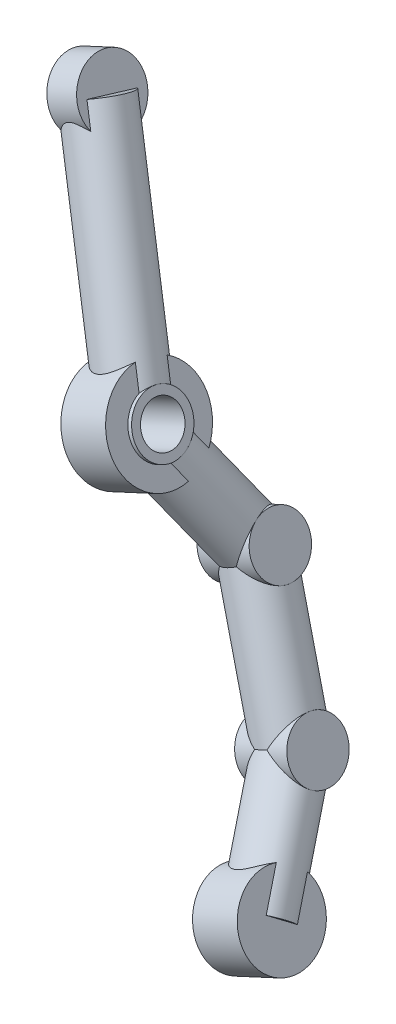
ISO-10303-21;
HEADER;
FILE_DESCRIPTION(('STEP AP214'),'2;1');
FILE_NAME('part.step','',(''),(''),'','','');
FILE_SCHEMA(('AUTOMOTIVE_DESIGN { 1 0 10303 214 1 1 1 1 }'));
ENDSEC;
DATA;
#1=APPLICATION_CONTEXT('core data for automotive mechanical design processes');
#2=APPLICATION_PROTOCOL_DEFINITION('international standard','automotive_design',2000,#1);
#3=PRODUCT_CONTEXT('',#1,'mechanical');
#4=PRODUCT('Part','Part','',(#3));
#5=PRODUCT_RELATED_PRODUCT_CATEGORY('part','',(#4));
#6=PRODUCT_DEFINITION_FORMATION('','',#4);
#7=PRODUCT_DEFINITION_CONTEXT('part definition',#1,'design');
#8=PRODUCT_DEFINITION('design','',#6,#7);
#9=PRODUCT_DEFINITION_SHAPE('','',#8);
#10=(LENGTH_UNIT() NAMED_UNIT(*) SI_UNIT(.MILLI.,.METRE.));
#11=(NAMED_UNIT(*) PLANE_ANGLE_UNIT() SI_UNIT($,.RADIAN.));
#12=(NAMED_UNIT(*) SI_UNIT($,.STERADIAN.) SOLID_ANGLE_UNIT());
#13=UNCERTAINTY_MEASURE_WITH_UNIT(LENGTH_MEASURE(1.E-05),#10,'distance_accuracy_value','');
#14=(GEOMETRIC_REPRESENTATION_CONTEXT(3) GLOBAL_UNCERTAINTY_ASSIGNED_CONTEXT((#13)) GLOBAL_UNIT_ASSIGNED_CONTEXT((#10,
#11,#12)) REPRESENTATION_CONTEXT('',''));
#15=CARTESIAN_POINT('',(0.,0.,0.));
#16=DIRECTION('',(0.,0.,1.));
#17=DIRECTION('',(1.,0.,0.));
#18=AXIS2_PLACEMENT_3D('',#15,#16,#17);
#19=CARTESIAN_POINT('',(455.341566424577,345.362620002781,-22.));
#20=DIRECTION('',(0.336774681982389,-0.725660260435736,0.600000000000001));
#21=DIRECTION('',(0.,-0.637223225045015,-0.77067928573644));
#22=AXIS2_PLACEMENT_3D('',#19,#20,#21);
#23=PLANE('',#22);
#24=CARTESIAN_POINT('',(455.341566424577,345.362620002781,-22.));
#25=DIRECTION('',(0.336774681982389,-0.725660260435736,0.600000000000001));
#26=DIRECTION('',(0.,-0.637223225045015,-0.77067928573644));
#27=AXIS2_PLACEMENT_3D('',#24,#25,#26);
#28=CIRCLE('',#27,3.50000000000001);
#29=CARTESIAN_POINT('',(452.164993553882,345.080866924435,-20.5577794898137));
#30=VERTEX_POINT('',#29);
#31=CARTESIAN_POINT('',(453.075687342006,343.118562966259,-23.4422205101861));
#32=VERTEX_POINT('',#31);
#33=EDGE_CURVE('E276',#30,#32,#28,.T.);
#34=ORIENTED_EDGE('',*,*,#33,.T.);
#35=DIRECTION('',(-0.252581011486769,0.544245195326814,0.799999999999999));
#36=VECTOR('',#35,1.);
#37=CARTESIAN_POINT('',(452.620340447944,344.099714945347,-21.9999999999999));
#38=LINE('',#37,#36);
#39=EDGE_CURVE('E301',#32,#30,#38,.T.);
#40=ORIENTED_EDGE('',*,*,#39,.T.);
#41=EDGE_LOOP('',(#34,#40));
#42=FACE_BOUND('',#41,.T.);
#43=ADVANCED_FACE('F100',(#42),#23,.T.);
#44=CARTESIAN_POINT('',(450.289946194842,356.247523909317,-31.));
#45=DIRECTION('',(0.336774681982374,-0.725660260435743,0.600000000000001));
#46=DIRECTION('',(0.,-0.637223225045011,-0.770679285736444));
#47=AXIS2_PLACEMENT_3D('',#44,#45,#46);
#48=CYLINDRICAL_SURFACE('',#47,3.50000000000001);
#49=CARTESIAN_POINT('',(450.289946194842,356.247523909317,-31.));
#50=DIRECTION('',(0.879534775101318,-0.215449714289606,0.42426406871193));
#51=DIRECTION('',(-0.403263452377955,-0.810788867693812,0.424264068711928));
#52=AXIS2_PLACEMENT_3D('',#49,#50,#51);
#53=ELLIPSE('',#52,4.94974746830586,3.50000000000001);
#54=CARTESIAN_POINT('',(448.293893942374,352.234323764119,-28.9));
#55=VERTEX_POINT('',#54);
#56=CARTESIAN_POINT('',(448.958208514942,357.147420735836,-27.7822113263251));
#57=VERTEX_POINT('',#56);
#58=EDGE_CURVE('E557',#55,#57,#53,.F.);
#59=ORIENTED_EDGE('',*,*,#58,.F.);
#60=CARTESIAN_POINT('',(451.173979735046,354.342665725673,-33.8));
#61=VERTEX_POINT('',#60);
#62=EDGE_CURVE('E554',#61,#55,#53,.F.);
#63=ORIENTED_EDGE('',*,*,#62,.F.);
#64=CARTESIAN_POINT('',(450.289946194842,356.247523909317,-31.));
#65=DIRECTION('',(-0.403263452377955,-0.810788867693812,0.424264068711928));
#66=DIRECTION('',(0.879534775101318,-0.215449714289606,0.42426406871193));
#67=AXIS2_PLACEMENT_3D('',#64,#65,#66);
#68=ELLIPSE('',#67,4.94974746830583,3.50000000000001);
#69=CARTESIAN_POINT('',(454.643421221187,355.181102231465,-28.9));
#70=VERTEX_POINT('',#69);
#71=EDGE_CURVE('E550',#70,#61,#68,.F.);
#72=ORIENTED_EDGE('',*,*,#71,.F.);
#73=CARTESIAN_POINT('',(450.46242659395,357.845519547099,-27.7822113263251));
#74=VERTEX_POINT('',#73);
#75=EDGE_CURVE('E553',#74,#70,#68,.F.);
#76=ORIENTED_EDGE('',*,*,#75,.F.);
#77=CARTESIAN_POINT('',(450.289946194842,356.247523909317,-31.));
#78=DIRECTION('',(0.387024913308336,-0.833936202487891,0.393398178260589));
#79=DIRECTION('',(0.165608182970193,-0.356841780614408,-0.919368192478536));
#80=AXIS2_PLACEMENT_3D('',#77,#78,#79);
#81=ELLIPSE('',#80,3.60255219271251,3.50000000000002);
#82=EDGE_CURVE('E533',#74,#57,#81,.T.);
#83=ORIENTED_EDGE('',*,*,#82,.T.);
#84=EDGE_LOOP('',(#59,#63,#72,#76,#83));
#85=FACE_BOUND('',#84,.T.);
#86=CARTESIAN_POINT('',(451.505074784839,346.502817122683,-26.2404342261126));
#87=CARTESIAN_POINT('',(451.588915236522,346.451164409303,-26.2917693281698));
#88=CARTESIAN_POINT('',(451.676001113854,346.401365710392,-26.339564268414));
#89=CARTESIAN_POINT('',(451.855742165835,346.306144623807,-26.4284221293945));
#90=CARTESIAN_POINT('',(451.948393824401,346.260719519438,-26.4694892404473));
#91=CARTESIAN_POINT('',(452.139014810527,346.174593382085,-26.5455275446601));
#92=CARTESIAN_POINT('',(452.237012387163,346.13392192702,-26.580461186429));
#93=CARTESIAN_POINT('',(452.43708178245,346.058315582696,-26.6444042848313));
#94=CARTESIAN_POINT('',(452.539154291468,346.02338167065,-26.6734127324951));
#95=CARTESIAN_POINT('',(452.746535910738,345.96011135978,-26.7259561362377));
#96=CARTESIAN_POINT('',(452.851839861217,345.931765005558,-26.7494993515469));
#97=CARTESIAN_POINT('',(453.065102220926,345.882564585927,-26.7916828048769));
#98=CARTESIAN_POINT('',(453.173060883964,345.861711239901,-26.8103225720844));
#99=CARTESIAN_POINT('',(453.499386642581,345.812182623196,-26.8595835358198));
#100=CARTESIAN_POINT('',(453.721053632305,345.796264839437,-26.8837507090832));
#101=CARTESIAN_POINT('',(454.093176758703,345.807583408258,-26.9132893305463));
#102=CARTESIAN_POINT('',(454.243749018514,345.822653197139,-26.9221993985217));
#103=CARTESIAN_POINT('',(454.540601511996,345.877031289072,-26.9351209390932));
#104=CARTESIAN_POINT('',(454.686889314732,345.916293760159,-26.9391416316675));
#105=CARTESIAN_POINT('',(454.970959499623,346.020497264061,-26.9430304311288));
#106=CARTESIAN_POINT('',(455.108697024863,346.085562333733,-26.9428782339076));
#107=CARTESIAN_POINT('',(455.370400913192,346.239120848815,-26.938342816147));
#108=CARTESIAN_POINT('',(455.49435398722,346.327636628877,-26.9339555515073));
#109=CARTESIAN_POINT('',(455.745199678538,346.539286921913,-26.9190282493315));
#110=CARTESIAN_POINT('',(455.869230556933,346.66571965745,-26.9075959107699));
#111=CARTESIAN_POINT('',(456.095851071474,346.935730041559,-26.8759660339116));
#112=CARTESIAN_POINT('',(456.198383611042,347.079351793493,-26.8557455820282));
#113=CARTESIAN_POINT('',(456.408882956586,347.417699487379,-26.7973236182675));
#114=CARTESIAN_POINT('',(456.510675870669,347.615664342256,-26.7557181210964));
#115=CARTESIAN_POINT('',(456.684864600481,348.018153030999,-26.6504126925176));
#116=CARTESIAN_POINT('',(456.757305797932,348.222666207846,-26.5867471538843));
#117=CARTESIAN_POINT('',(456.84468751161,348.527834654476,-26.4718899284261));
#118=CARTESIAN_POINT('',(456.870258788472,348.629228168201,-26.4304094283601));
#119=CARTESIAN_POINT('',(456.914250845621,348.830377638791,-26.3406357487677));
#120=CARTESIAN_POINT('',(456.932680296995,348.930135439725,-26.2923509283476));
#121=CARTESIAN_POINT('',(456.947526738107,349.028627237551,-26.2404342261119));
#122=B_SPLINE_CURVE_WITH_KNOTS('',3,(#86,#87,#88,#89,#90,#91,#92,#93,#94,#95,#96,#97,#98,#99,
#100,#101,#102,#103,#104,#105,#106,#107,#108,#109,#110,#111,#112,#113,#114,#115,#116,#117,#118,
#119,#120,#121),.UNSPECIFIED.,.F.,.F.,(4,2,2,2,2,2,2,2,2,2,2,2,2,2,2,2,2,4),(0.,
0.332966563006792,0.66572494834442,1.00045449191,1.3352409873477,1.66951820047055,
2.0038274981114,2.66972985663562,3.12280153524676,3.5750175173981,4.02943424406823,
4.48428532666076,5.01385226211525,5.5448083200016,6.22088122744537,6.89590480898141,
7.23299855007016,7.56968172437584),.UNSPECIFIED.);
#123=CARTESIAN_POINT('',(451.505074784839,346.502817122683,-26.2404342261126));
#124=VERTEX_POINT('',#123);
#125=CARTESIAN_POINT('',(456.947526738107,349.028627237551,-26.2404342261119));
#126=VERTEX_POINT('',#125);
#127=EDGE_CURVE('E118',#124,#126,#122,.T.);
#128=ORIENTED_EDGE('',*,*,#127,.F.);
#129=DIRECTION('',(0.336774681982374,-0.725660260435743,0.600000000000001));
#130=VECTOR('',#129,1.);
#131=CARTESIAN_POINT('',(448.02406711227,354.003466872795,-32.4422205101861));
#132=LINE('',#131,#130);
#133=EDGE_CURVE('E12',#124,#32,#132,.T.);
#134=ORIENTED_EDGE('',*,*,#133,.T.);
#135=ORIENTED_EDGE('',*,*,#33,.F.);
#136=DIRECTION('',(0.336774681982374,-0.725660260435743,0.600000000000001));
#137=VECTOR('',#136,1.);
#138=CARTESIAN_POINT('',(447.113373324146,355.965770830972,-29.5577794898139));
#139=LINE('',#138,#137);
#140=CARTESIAN_POINT('',(450.594380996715,348.465121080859,-23.3559932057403));
#141=VERTEX_POINT('',#140);
#142=EDGE_CURVE('E270',#30,#141,#139,.F.);
#143=ORIENTED_EDGE('',*,*,#142,.T.);
#144=CARTESIAN_POINT('',(456.036832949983,350.990931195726,-23.3559932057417));
#145=CARTESIAN_POINT('',(455.976510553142,350.991908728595,-23.2627581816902));
#146=CARTESIAN_POINT('',(455.914203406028,350.988315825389,-23.1708172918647));
#147=CARTESIAN_POINT('',(455.785864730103,350.972778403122,-22.9903806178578));
#148=CARTESIAN_POINT('',(455.719835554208,350.960839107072,-22.901882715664));
#149=CARTESIAN_POINT('',(455.583820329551,350.929304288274,-22.7285584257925));
#150=CARTESIAN_POINT('',(455.513813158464,350.909663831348,-22.6437568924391));
#151=CARTESIAN_POINT('',(455.37023904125,350.863537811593,-22.4791614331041));
#152=CARTESIAN_POINT('',(455.29667149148,350.837051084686,-22.3993683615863));
#153=CARTESIAN_POINT('',(455.146021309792,350.778080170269,-22.2457518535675));
#154=CARTESIAN_POINT('',(455.068944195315,350.745605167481,-22.1719195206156));
#155=CARTESIAN_POINT('',(454.911057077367,350.675486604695,-22.0310791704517));
#156=CARTESIAN_POINT('',(454.830246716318,350.63784254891,-21.9640718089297));
#157=CARTESIAN_POINT('',(454.582243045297,350.518607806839,-21.7752716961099));
#158=CARTESIAN_POINT('',(454.408871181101,350.430462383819,-21.6650616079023));
#159=CARTESIAN_POINT('',(454.103688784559,350.274904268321,-21.5162609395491));
#160=CARTESIAN_POINT('',(453.976305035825,350.209869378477,-21.4660380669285));
#161=CARTESIAN_POINT('',(453.71498864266,350.07892040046,-21.3898051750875));
#162=CARTESIAN_POINT('',(453.581068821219,350.013008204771,-21.3637496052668));
#163=CARTESIAN_POINT('',(453.308932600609,349.883090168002,-21.3385991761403));
#164=CARTESIAN_POINT('',(453.170698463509,349.819095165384,-21.3396361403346));
#165=CARTESIAN_POINT('',(452.895136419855,349.695397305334,-21.3688613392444));
#166=CARTESIAN_POINT('',(452.757809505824,349.635698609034,-21.3970755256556));
#167=CARTESIAN_POINT('',(452.466448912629,349.511347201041,-21.4841844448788));
#168=CARTESIAN_POINT('',(452.313376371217,349.447491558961,-21.5473576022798));
#169=CARTESIAN_POINT('',(452.018971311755,349.323538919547,-21.6997528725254));
#170=CARTESIAN_POINT('',(451.877670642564,349.263452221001,-21.7890428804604));
#171=CARTESIAN_POINT('',(451.573156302,349.127681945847,-22.0149625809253));
#172=CARTESIAN_POINT('',(451.414508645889,349.052224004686,-22.157860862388));
#173=CARTESIAN_POINT('',(451.125665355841,348.896785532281,-22.4674356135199));
#174=CARTESIAN_POINT('',(450.995425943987,348.816812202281,-22.6340748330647));
#175=CARTESIAN_POINT('',(450.825126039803,348.690310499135,-22.8966596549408));
#176=CARTESIAN_POINT('',(450.77256080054,348.647081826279,-22.9862327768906));
#177=CARTESIAN_POINT('',(450.676512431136,348.558099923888,-23.1687503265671));
#178=CARTESIAN_POINT('',(450.633018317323,348.512349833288,-23.2616905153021));
#179=CARTESIAN_POINT('',(450.594380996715,348.465121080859,-23.3559932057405));
#180=B_SPLINE_CURVE_WITH_KNOTS('',3,(#144,#145,#146,#147,#148,#149,#150,#151,#152,#153,#154,
#155,#156,#157,#158,#159,#160,#161,#162,#163,#164,#165,#166,#167,#168,#169,#170,#171,#172,#173,
#174,#175,#176,#177,#178,#179),.UNSPECIFIED.,.F.,.F.,(4,2,2,2,2,2,2,2,2,2,2,2,2,2,2,2,2,4),(0.,
0.332966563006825,0.66572494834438,1.00045449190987,1.33524098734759,1.66951820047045,
2.00382749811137,2.66972985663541,3.1228015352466,3.57501751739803,4.02943424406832,
4.48428532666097,5.01385226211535,5.54480832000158,6.22088122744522,6.89590480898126,
7.23299855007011,7.56968172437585),.UNSPECIFIED.);
#181=CARTESIAN_POINT('',(456.036832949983,350.990931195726,-23.3559932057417));
#182=VERTEX_POINT('',#181);
#183=EDGE_CURVE('E273',#182,#141,#180,.T.);
#184=ORIENTED_EDGE('',*,*,#183,.F.);
#185=DIRECTION('',(0.336774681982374,-0.725660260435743,0.600000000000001));
#186=VECTOR('',#185,1.);
#187=CARTESIAN_POINT('',(452.555825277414,358.491580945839,-29.557779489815));
#188=LINE('',#187,#186);
#189=CARTESIAN_POINT('',(457.60744550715,347.606677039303,-20.5577794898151));
#190=VERTEX_POINT('',#189);
#191=EDGE_CURVE('E280',#190,#182,#188,.F.);
#192=ORIENTED_EDGE('',*,*,#191,.F.);
#193=CARTESIAN_POINT('',(458.518139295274,345.644373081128,-23.442220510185));
#194=VERTEX_POINT('',#193);
#195=EDGE_CURVE('E456',#194,#190,#28,.T.);
#196=ORIENTED_EDGE('',*,*,#195,.F.);
#197=DIRECTION('',(0.336774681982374,-0.725660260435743,0.600000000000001));
#198=VECTOR('',#197,1.);
#199=CARTESIAN_POINT('',(453.466519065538,356.529276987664,-32.442220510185));
#200=LINE('',#199,#198);
#201=EDGE_CURVE('E109',#126,#194,#200,.T.);
#202=ORIENTED_EDGE('',*,*,#201,.F.);
#203=EDGE_LOOP('',(#128,#134,#135,#143,#184,#192,#196,#202));
#204=FACE_BOUND('',#203,.T.);
#205=ADVANCED_FACE('F272',(#85,#204),#48,.T.);
#206=CARTESIAN_POINT('',(424.610876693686,411.579118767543,-33.));
#207=DIRECTION('',(0.408399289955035,-0.879992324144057,0.242535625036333));
#208=DIRECTION('',(0.90707532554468,0.420968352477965,0.));
#209=AXIS2_PLACEMENT_3D('',#206,#207,#208);
#210=CYLINDRICAL_SURFACE('',#209,3.49999999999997);
#211=CARTESIAN_POINT('',(431.523655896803,389.557483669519,-29.1369228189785));
#212=CARTESIAN_POINT('',(431.592044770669,389.535963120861,-29.2157090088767));
#213=CARTESIAN_POINT('',(431.664062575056,389.515336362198,-29.2915448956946));
#214=CARTESIAN_POINT('',(431.814551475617,389.476477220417,-29.437133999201));
#215=CARTESIAN_POINT('',(431.893020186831,389.458243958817,-29.5068894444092));
#216=CARTESIAN_POINT('',(432.055980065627,389.424695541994,-29.640457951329));
#217=CARTESIAN_POINT('',(432.14049386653,389.409392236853,-29.7042463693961));
#218=CARTESIAN_POINT('',(432.314501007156,389.382463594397,-29.8254576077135));
#219=CARTESIAN_POINT('',(432.403994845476,389.370838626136,-29.8828797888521));
#220=CARTESIAN_POINT('',(432.678790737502,389.342553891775,-30.0454035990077));
#221=CARTESIAN_POINT('',(432.870621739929,389.332437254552,-30.1409358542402));
#222=CARTESIAN_POINT('',(433.264963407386,389.336266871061,-30.3049910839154));
#223=CARTESIAN_POINT('',(433.467449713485,389.350160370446,-30.3735728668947));
#224=CARTESIAN_POINT('',(433.831873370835,389.402324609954,-30.4705902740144));
#225=CARTESIAN_POINT('',(433.993187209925,389.434724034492,-30.5044828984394));
#226=CARTESIAN_POINT('',(434.312944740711,389.520682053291,-30.5537054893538));
#227=CARTESIAN_POINT('',(434.471391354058,389.574217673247,-30.569055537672));
#228=CARTESIAN_POINT('',(434.780617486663,389.702682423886,-30.5806395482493));
#229=CARTESIAN_POINT('',(434.931375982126,389.777666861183,-30.5768236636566));
#230=CARTESIAN_POINT('',(435.22030185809,389.946229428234,-30.550124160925));
#231=CARTESIAN_POINT('',(435.358462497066,390.039817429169,-30.5272303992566));
#232=CARTESIAN_POINT('',(435.615751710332,390.237892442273,-30.4641353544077));
#233=CARTESIAN_POINT('',(435.73531368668,390.341988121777,-30.4244513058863));
#234=CARTESIAN_POINT('',(435.959465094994,390.558476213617,-30.3287850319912));
#235=CARTESIAN_POINT('',(436.064044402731,390.670874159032,-30.2727918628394));
#236=CARTESIAN_POINT('',(436.273580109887,390.917329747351,-30.1352878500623));
#237=CARTESIAN_POINT('',(436.376054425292,391.052032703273,-30.0511599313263));
#238=CARTESIAN_POINT('',(436.561934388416,391.320443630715,-29.8628365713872));
#239=CARTESIAN_POINT('',(436.645347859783,391.454151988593,-29.7586493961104));
#240=CARTESIAN_POINT('',(436.768914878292,391.671719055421,-29.5686043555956));
#241=CARTESIAN_POINT('',(436.814239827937,391.75740049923,-29.4881313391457));
#242=CARTESIAN_POINT('',(436.8964696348,391.924159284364,-29.3187867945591));
#243=CARTESIAN_POINT('',(436.933384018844,392.005241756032,-29.2299249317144));
#244=CARTESIAN_POINT('',(436.966107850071,392.083293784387,-29.1369228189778));
#245=B_SPLINE_CURVE_WITH_KNOTS('',3,(#211,#212,#213,#214,#215,#216,#217,#218,#219,#220,#221,
#222,#223,#224,#225,#226,#227,#228,#229,#230,#231,#232,#233,#234,#235,#236,#237,#238,#239,#240,
#241,#242,#243,#244),.UNSPECIFIED.,.F.,.F.,(4,2,2,2,2,2,2,2,2,2,2,2,2,2,2,2,4),(0.,
0.319418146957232,0.63871872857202,0.959284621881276,1.27988266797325,1.92024942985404,
2.55921098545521,3.06104886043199,3.56234275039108,4.064941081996,4.56780681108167,
5.05619570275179,5.54491307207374,6.10980771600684,6.67447007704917,7.0518172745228,
7.42873489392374),.UNSPECIFIED.);
#246=CARTESIAN_POINT('',(431.523655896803,389.557483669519,-29.1369228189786));
#247=VERTEX_POINT('',#246);
#248=CARTESIAN_POINT('',(436.966107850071,392.083293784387,-29.1369228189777));
#249=VERTEX_POINT('',#248);
#250=EDGE_CURVE('E391',#247,#249,#245,.T.);
#251=ORIENTED_EDGE('',*,*,#250,.F.);
#252=DIRECTION('',(0.408399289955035,-0.879992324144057,0.242535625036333));
#253=VECTOR('',#252,1.);
#254=CARTESIAN_POINT('',(422.073713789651,409.919606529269,-34.7489492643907));
#255=LINE('',#254,#253);
#256=CARTESIAN_POINT('',(432.635629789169,387.16147438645,-28.4765561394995));
#257=VERTEX_POINT('',#256);
#258=EDGE_CURVE('E327',#247,#257,#255,.T.);
#259=ORIENTED_EDGE('',*,*,#258,.T.);
#260=CARTESIAN_POINT('',(436.397990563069,386.181009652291,-26.));
#261=DIRECTION('',(-0.352617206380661,-0.919918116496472,0.171498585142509));
#262=DIRECTION('',(0.930181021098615,-0.324578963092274,0.171498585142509));
#263=AXIS2_PLACEMENT_3D('',#260,#261,#262);
#264=ELLIPSE('',#263,4.9497474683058,3.49999999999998);
#265=CARTESIAN_POINT('',(431.79382940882,387.787593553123,-26.8488746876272));
#266=VERTEX_POINT('',#265);
#267=EDGE_CURVE('E509',#266,#257,#264,.T.);
#268=ORIENTED_EDGE('',*,*,#267,.F.);
#269=CARTESIAN_POINT('',(432.26750364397,387.954688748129,-24.9786576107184));
#270=VERTEX_POINT('',#269);
#271=EDGE_CURVE('E523',#270,#266,#264,.T.);
#272=ORIENTED_EDGE('',*,*,#271,.F.);
#273=DIRECTION('',(0.408399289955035,-0.879992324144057,0.242535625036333));
#274=VECTOR('',#273,1.);
#275=CARTESIAN_POINT('',(421.705587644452,410.712820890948,-31.2510507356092));
#276=LINE('',#275,#274);
#277=CARTESIAN_POINT('',(431.155529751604,390.350698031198,-25.6390242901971));
#278=VERTEX_POINT('',#277);
#279=EDGE_CURVE('E335',#270,#278,#276,.F.);
#280=ORIENTED_EDGE('',*,*,#279,.T.);
#281=CARTESIAN_POINT('',(436.597981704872,392.876508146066,-25.639024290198));
#282=CARTESIAN_POINT('',(436.552266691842,392.849172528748,-25.5467728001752));
#283=CARTESIAN_POINT('',(436.504075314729,392.818459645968,-25.4567871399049));
#284=CARTESIAN_POINT('',(436.402875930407,392.751112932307,-25.2819265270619));
#285=CARTESIAN_POINT('',(436.349869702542,392.714481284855,-25.1970497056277));
#286=CARTESIAN_POINT('',(436.238923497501,392.635954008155,-25.0325918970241));
#287=CARTESIAN_POINT('',(436.180964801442,392.594038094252,-24.9530332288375));
#288=CARTESIAN_POINT('',(436.060346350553,392.505928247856,-24.8001161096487));
#289=CARTESIAN_POINT('',(435.997686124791,392.459733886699,-24.726758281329));
#290=CARTESIAN_POINT('',(435.802690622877,392.316069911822,-24.516843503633));
#291=CARTESIAN_POINT('',(435.663196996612,392.213413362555,-24.3902297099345));
#292=CARTESIAN_POINT('',(435.365147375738,392.002099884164,-24.168989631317));
#293=CARTESIAN_POINT('',(435.20663388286,391.893456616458,-24.0742937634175));
#294=CARTESIAN_POINT('',(434.907060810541,391.701556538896,-23.938763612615));
#295=CARTESIAN_POINT('',(434.769555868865,391.617855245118,-23.8907316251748));
#296=CARTESIAN_POINT('',(434.484927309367,391.45620359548,-23.8206470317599));
#297=CARTESIAN_POINT('',(434.337814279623,391.378247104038,-23.7985663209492));
#298=CARTESIAN_POINT('',(434.037107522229,391.231425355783,-23.7819229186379));
#299=CARTESIAN_POINT('',(433.883497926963,391.162584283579,-23.7874319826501));
#300=CARTESIAN_POINT('',(433.575082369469,391.036016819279,-23.8257058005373));
#301=CARTESIAN_POINT('',(433.420275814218,390.978296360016,-23.8584850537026));
#302=CARTESIAN_POINT('',(433.118940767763,390.875128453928,-23.9477375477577));
#303=CARTESIAN_POINT('',(432.972302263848,390.829375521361,-24.003501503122));
#304=CARTESIAN_POINT('',(432.686268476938,390.746227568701,-24.1359177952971));
#305=CARTESIAN_POINT('',(432.546878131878,390.70883819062,-24.2125841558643));
#306=CARTESIAN_POINT('',(432.257332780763,390.634782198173,-24.3976034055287));
#307=CARTESIAN_POINT('',(432.108886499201,390.599136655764,-24.5090326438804));
#308=CARTESIAN_POINT('',(431.829392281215,390.532439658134,-24.7529505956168));
#309=CARTESIAN_POINT('',(431.698337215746,390.501386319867,-24.8854306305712));
#310=CARTESIAN_POINT('',(431.497256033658,390.450841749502,-25.121508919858));
#311=CARTESIAN_POINT('',(431.421406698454,390.430932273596,-25.2201094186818));
#312=CARTESIAN_POINT('',(431.280292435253,390.391053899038,-25.4244236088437));
#313=CARTESIAN_POINT('',(431.215015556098,390.371085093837,-25.5301290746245));
#314=CARTESIAN_POINT('',(431.155529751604,390.350698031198,-25.6390242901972));
#315=B_SPLINE_CURVE_WITH_KNOTS('',3,(#281,#282,#283,#284,#285,#286,#287,#288,#289,#290,#291,
#292,#293,#294,#295,#296,#297,#298,#299,#300,#301,#302,#303,#304,#305,#306,#307,#308,#309,#310,
#311,#312,#313,#314),.UNSPECIFIED.,.F.,.F.,(4,2,2,2,2,2,2,2,2,2,2,2,2,2,2,2,4),(0.,
0.319418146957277,0.638718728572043,0.959284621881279,1.27988266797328,1.92024942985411,
2.55921098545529,3.06104886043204,3.56234275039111,4.06494108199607,4.56780681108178,
5.05619570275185,5.54491307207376,6.10980771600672,6.67447007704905,7.05181727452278,
7.4287348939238),.UNSPECIFIED.);
#316=CARTESIAN_POINT('',(436.597981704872,392.876508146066,-25.639024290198));
#317=VERTEX_POINT('',#316);
#318=EDGE_CURVE('E383',#317,#278,#315,.T.);
#319=ORIENTED_EDGE('',*,*,#318,.F.);
#320=DIRECTION('',(0.408399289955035,-0.879992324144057,0.242535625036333));
#321=VECTOR('',#320,1.);
#322=CARTESIAN_POINT('',(427.148039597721,413.238631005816,-31.2510507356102));
#323=LINE('',#322,#321);
#324=CARTESIAN_POINT('',(437.709955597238,390.480498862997,-24.978657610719));
#325=VERTEX_POINT('',#324);
#326=EDGE_CURVE('E339',#325,#317,#323,.F.);
#327=ORIENTED_EDGE('',*,*,#326,.F.);
#328=CARTESIAN_POINT('',(436.397990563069,386.181009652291,-26.));
#329=DIRECTION('',(0.930181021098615,-0.324578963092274,0.171498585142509));
#330=DIRECTION('',(-0.352617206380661,-0.919918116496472,0.171498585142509));
#331=AXIS2_PLACEMENT_3D('',#328,#329,#330);
#332=ELLIPSE('',#331,4.94974746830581,3.49999999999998);
#333=CARTESIAN_POINT('',(438.143356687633,390.734372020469,-26.8488746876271));
#334=VERTEX_POINT('',#333);
#335=EDGE_CURVE('E524',#334,#325,#332,.T.);
#336=ORIENTED_EDGE('',*,*,#335,.F.);
#337=CARTESIAN_POINT('',(438.078081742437,389.687284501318,-28.4765561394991));
#338=VERTEX_POINT('',#337);
#339=EDGE_CURVE('E525',#338,#334,#332,.T.);
#340=ORIENTED_EDGE('',*,*,#339,.F.);
#341=DIRECTION('',(0.408399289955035,-0.879992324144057,0.242535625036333));
#342=VECTOR('',#341,1.);
#343=CARTESIAN_POINT('',(427.51616574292,412.445416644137,-34.7489492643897));
#344=LINE('',#343,#342);
#345=EDGE_CURVE('E347',#249,#338,#344,.T.);
#346=ORIENTED_EDGE('',*,*,#345,.F.);
#347=EDGE_LOOP('',(#251,#259,#268,#272,#280,#319,#327,#336,#340,#346));
#348=FACE_BOUND('',#347,.T.);
#349=CARTESIAN_POINT('',(423.640402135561,408.919283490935,-29.5382872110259));
#350=CARTESIAN_POINT('',(423.67755346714,409.001783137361,-29.5039990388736));
#351=CARTESIAN_POINT('',(423.71642867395,409.084507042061,-29.4720776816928));
#352=CARTESIAN_POINT('',(423.798256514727,409.24977594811,-29.4127378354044));
#353=CARTESIAN_POINT('',(423.841217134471,409.332320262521,-29.3853284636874));
#354=CARTESIAN_POINT('',(423.932620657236,409.497932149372,-29.3344053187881));
#355=CARTESIAN_POINT('',(423.981157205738,409.580976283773,-29.3109820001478));
#356=CARTESIAN_POINT('',(424.083833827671,409.744618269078,-29.268595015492));
#357=CARTESIAN_POINT('',(424.137968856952,409.825218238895,-29.2496273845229));
#358=CARTESIAN_POINT('',(424.265336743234,409.99924124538,-29.2124239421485));
#359=CARTESIAN_POINT('',(424.340179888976,410.09173076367,-29.1952078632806));
#360=CARTESIAN_POINT('',(424.501887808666,410.265949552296,-29.1671674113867));
#361=CARTESIAN_POINT('',(424.588677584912,410.347740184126,-29.1563052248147));
#362=CARTESIAN_POINT('',(424.75976755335,410.482320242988,-29.142261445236));
#363=CARTESIAN_POINT('',(424.841933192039,410.537678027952,-29.1380808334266));
#364=CARTESIAN_POINT('',(425.014479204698,410.633841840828,-29.1341701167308));
#365=CARTESIAN_POINT('',(425.10485381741,410.674657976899,-29.1344369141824));
#366=CARTESIAN_POINT('',(425.290657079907,410.740537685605,-29.1393992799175));
#367=CARTESIAN_POINT('',(425.386069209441,410.765649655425,-29.1440811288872));
#368=CARTESIAN_POINT('',(425.579289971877,410.80195447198,-29.1577747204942));
#369=CARTESIAN_POINT('',(425.677103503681,410.813115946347,-29.1667961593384));
#370=CARTESIAN_POINT('',(425.86046258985,410.823554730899,-29.1877007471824));
#371=CARTESIAN_POINT('',(425.946005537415,410.824148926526,-29.1990819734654));
#372=CARTESIAN_POINT('',(426.116383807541,410.818617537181,-29.2251201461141));
#373=CARTESIAN_POINT('',(426.201218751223,410.812488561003,-29.2397787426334));
#374=CARTESIAN_POINT('',(426.369903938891,410.794981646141,-29.272462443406));
#375=CARTESIAN_POINT('',(426.45375089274,410.783589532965,-29.290496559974));
#376=CARTESIAN_POINT('',(426.619921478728,410.756720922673,-29.3299809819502));
#377=CARTESIAN_POINT('',(426.70224573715,410.741246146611,-29.3514298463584));
#378=CARTESIAN_POINT('',(426.866683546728,410.706792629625,-29.3982740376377));
#379=CARTESIAN_POINT('',(426.948766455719,410.68775566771,-29.4237336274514));
#380=CARTESIAN_POINT('',(427.110475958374,410.647176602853,-29.4782632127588));
#381=CARTESIAN_POINT('',(427.190114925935,410.625651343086,-29.50730901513));
#382=CARTESIAN_POINT('',(427.268703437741,410.603156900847,-29.5382872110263));
#383=B_SPLINE_CURVE_WITH_KNOTS('',3,(#349,#350,#351,#352,#353,#354,#355,#356,#357,#358,#359,
#360,#361,#362,#363,#364,#365,#366,#367,#368,#369,#370,#371,#372,#373,#374,#375,#376,#377,#378,
#379,#380,#381,#382),.UNSPECIFIED.,.F.,.F.,(4,2,2,2,2,2,2,2,2,2,2,2,2,2,2,2,4),(0.,
0.290250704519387,0.581080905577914,0.877819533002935,1.17429309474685,1.53402688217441,
1.89159743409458,2.18772895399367,2.48365422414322,2.77866295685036,3.0743339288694,
3.33285850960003,3.5915135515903,3.85086929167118,4.11011587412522,4.37404327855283,
4.63627861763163),.UNSPECIFIED.);
#384=CARTESIAN_POINT('',(423.640402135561,408.919283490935,-29.5382872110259));
#385=VERTEX_POINT('',#384);
#386=CARTESIAN_POINT('',(427.26870343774,410.603156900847,-29.5382872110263));
#387=VERTEX_POINT('',#386);
#388=EDGE_CURVE('E289',#385,#387,#383,.T.);
#389=ORIENTED_EDGE('',*,*,#388,.F.);
#390=DIRECTION('',(0.408399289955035,-0.879992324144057,0.242535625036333));
#391=VECTOR('',#390,1.);
#392=CARTESIAN_POINT('',(422.503466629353,411.369078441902,-30.2134778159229));
#393=LINE('',#392,#391);
#394=CARTESIAN_POINT('',(422.503466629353,411.369078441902,-30.2134778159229));
#395=VERTEX_POINT('',#394);
#396=EDGE_CURVE('E316',#385,#395,#393,.F.);
#397=ORIENTED_EDGE('',*,*,#396,.T.);
#398=CARTESIAN_POINT('',(424.610876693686,411.579118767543,-33.));
#399=DIRECTION('',(0.408399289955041,-0.879992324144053,0.242535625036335));
#400=DIRECTION('',(0.907075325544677,0.420968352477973,0.));
#401=AXIS2_PLACEMENT_3D('',#398,#399,#400);
#402=CIRCLE('',#401,3.49999999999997);
#403=CARTESIAN_POINT('',(423.08998545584,410.105285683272,-35.7865221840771));
#404=VERTEX_POINT('',#403);
#405=EDGE_CURVE('E529',#395,#404,#402,.T.);
#406=ORIENTED_EDGE('',*,*,#405,.T.);
#407=DIRECTION('',(0.408399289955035,-0.879992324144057,0.242535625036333));
#408=VECTOR('',#407,1.);
#409=CARTESIAN_POINT('',(423.08998545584,410.105285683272,-35.786522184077));
#410=LINE('',#409,#408);
#411=CARTESIAN_POINT('',(424.226920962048,407.655490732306,-35.1113315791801));
#412=VERTEX_POINT('',#411);
#413=EDGE_CURVE('E313',#404,#412,#410,.T.);
#414=ORIENTED_EDGE('',*,*,#413,.T.);
#415=CARTESIAN_POINT('',(427.855222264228,409.339364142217,-35.1113315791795));
#416=CARTESIAN_POINT('',(427.777957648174,409.343298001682,-35.1694417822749));
#417=CARTESIAN_POINT('',(427.698914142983,409.347126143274,-35.2252178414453));
#418=CARTESIAN_POINT('',(427.537346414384,409.353675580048,-35.331912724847));
#419=CARTESIAN_POINT('',(427.454815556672,409.356394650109,-35.3828216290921));
#420=CARTESIAN_POINT('',(427.284952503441,409.359842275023,-35.4803394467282));
#421=CARTESIAN_POINT('',(427.197556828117,409.360529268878,-35.526839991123));
#422=CARTESIAN_POINT('',(427.019906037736,409.358436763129,-35.6137518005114));
#423=CARTESIAN_POINT('',(426.929653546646,409.355660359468,-35.6541684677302));
#424=CARTESIAN_POINT('',(426.727059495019,409.343729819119,-35.736046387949));
#425=CARTESIAN_POINT('',(426.614113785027,409.333341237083,-35.7758903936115));
#426=CARTESIAN_POINT('',(426.386678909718,409.300746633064,-35.8429640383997));
#427=CARTESIAN_POINT('',(426.272203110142,409.278612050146,-35.8702680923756));
#428=CARTESIAN_POINT('',(426.064234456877,409.223495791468,-35.9062129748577));
#429=CARTESIAN_POINT('',(425.970515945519,409.19303138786,-35.9172544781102));
#430=CARTESIAN_POINT('',(425.787182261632,409.120112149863,-35.9275716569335));
#431=CARTESIAN_POINT('',(425.69756427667,409.07766568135,-35.9268555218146));
#432=CARTESIAN_POINT('',(425.525405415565,408.982385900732,-35.9137901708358));
#433=CARTESIAN_POINT('',(425.442843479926,408.929585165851,-35.9014769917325));
#434=CARTESIAN_POINT('',(425.285269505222,408.81647096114,-35.8666138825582));
#435=CARTESIAN_POINT('',(425.210274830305,408.756140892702,-35.8440410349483));
#436=CARTESIAN_POINT('',(425.076436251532,408.638998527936,-35.7937277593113));
#437=CARTESIAN_POINT('',(425.016746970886,408.582696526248,-35.7669928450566));
#438=CARTESIAN_POINT('',(424.902021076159,408.468311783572,-35.7079044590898));
#439=CARTESIAN_POINT('',(424.846986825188,408.410228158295,-35.6755481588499));
#440=CARTESIAN_POINT('',(424.740680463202,408.293325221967,-35.605819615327));
#441=CARTESIAN_POINT('',(424.689418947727,408.234504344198,-35.5684340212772));
#442=CARTESIAN_POINT('',(424.590170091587,408.1171743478,-35.4892068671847));
#443=CARTESIAN_POINT('',(424.542181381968,408.058665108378,-35.4473671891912));
#444=CARTESIAN_POINT('',(424.448081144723,407.941559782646,-35.3587517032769));
#445=CARTESIAN_POINT('',(424.402019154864,407.88298120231,-35.3119004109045));
#446=CARTESIAN_POINT('',(424.312617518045,407.767755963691,-35.2144294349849));
#447=CARTESIAN_POINT('',(424.269262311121,407.711099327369,-35.1638358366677));
#448=CARTESIAN_POINT('',(424.226920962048,407.655490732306,-35.1113315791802));
#449=B_SPLINE_CURVE_WITH_KNOTS('',3,(#415,#416,#417,#418,#419,#420,#421,#422,#423,#424,#425,
#426,#427,#428,#429,#430,#431,#432,#433,#434,#435,#436,#437,#438,#439,#440,#441,#442,#443,#444,
#445,#446,#447,#448),.UNSPECIFIED.,.F.,.F.,(4,2,2,2,2,2,2,2,2,2,2,2,2,2,2,2,4),(0.,
0.290250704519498,0.581080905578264,0.877819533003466,1.17429309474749,1.53402688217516,
1.89159743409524,2.18772895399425,2.48365422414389,2.77866295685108,3.07433392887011,
3.33285850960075,3.59151355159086,3.85086929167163,4.11011587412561,4.37404327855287,
4.63627861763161),.UNSPECIFIED.);
#450=CARTESIAN_POINT('',(427.855222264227,409.339364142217,-35.1113315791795));
#451=VERTEX_POINT('',#450);
#452=EDGE_CURVE('E409',#451,#412,#449,.T.);
#453=ORIENTED_EDGE('',*,*,#452,.F.);
#454=DIRECTION('',(0.408399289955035,-0.879992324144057,0.242535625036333));
#455=VECTOR('',#454,1.);
#456=CARTESIAN_POINT('',(426.718286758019,411.789159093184,-35.7865221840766));
#457=LINE('',#456,#455);
#458=CARTESIAN_POINT('',(426.718286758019,411.789159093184,-35.7865221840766));
#459=VERTEX_POINT('',#458);
#460=EDGE_CURVE('E309',#459,#451,#457,.T.);
#461=ORIENTED_EDGE('',*,*,#460,.F.);
#462=CARTESIAN_POINT('',(426.131767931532,413.052951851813,-30.2134778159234));
#463=VERTEX_POINT('',#462);
#464=EDGE_CURVE('E458',#459,#463,#402,.T.);
#465=ORIENTED_EDGE('',*,*,#464,.T.);
#466=DIRECTION('',(0.408399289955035,-0.879992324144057,0.242535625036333));
#467=VECTOR('',#466,1.);
#468=CARTESIAN_POINT('',(426.131767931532,413.052951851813,-30.2134778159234));
#469=LINE('',#468,#467);
#470=EDGE_CURVE('E311',#387,#463,#469,.F.);
#471=ORIENTED_EDGE('',*,*,#470,.F.);
#472=EDGE_LOOP('',(#389,#397,#406,#414,#453,#461,#465,#471));
#473=FACE_BOUND('',#472,.T.);
#474=ADVANCED_FACE('F399',(#348,#473),#210,.T.);
#475=CARTESIAN_POINT('',(424.610876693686,411.579118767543,-33.));
#476=DIRECTION('',(0.408399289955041,-0.879992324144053,0.242535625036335));
#477=DIRECTION('',(0.907075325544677,0.420968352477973,0.));
#478=AXIS2_PLACEMENT_3D('',#475,#476,#477);
#479=PLANE('',#478);
#480=DIRECTION('',(-0.102099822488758,0.219998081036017,0.970142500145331));
#481=VECTOR('',#480,1.);
#482=CARTESIAN_POINT('',(422.796726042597,410.737182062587,-33.));
#483=LINE('',#482,#481);
#484=EDGE_CURVE('E415',#404,#395,#483,.T.);
#485=ORIENTED_EDGE('',*,*,#484,.F.);
#486=ORIENTED_EDGE('',*,*,#405,.F.);
#487=EDGE_LOOP('',(#485,#486));
#488=FACE_BOUND('',#487,.T.);
#489=ADVANCED_FACE('F402',(#488),#479,.F.);
#490=CARTESIAN_POINT('',(436.397990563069,386.181009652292,-26.));
#491=DIRECTION('',(0.371442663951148,-0.800360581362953,-0.470588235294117));
#492=DIRECTION('',(0.,0.506850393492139,-0.862034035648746));
#493=AXIS2_PLACEMENT_3D('',#490,#491,#492);
#494=CYLINDRICAL_SURFACE('',#493,3.49999999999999);
#495=CARTESIAN_POINT('',(442.712515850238,372.574879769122,-34.));
#496=DIRECTION('',(0.90404874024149,-0.268270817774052,-0.332756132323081));
#497=DIRECTION('',(-0.378749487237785,-0.863609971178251,-0.332756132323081));
#498=AXIS2_PLACEMENT_3D('',#495,#496,#497);
#499=ELLIPSE('',#498,4.94974746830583,3.5);
#500=CARTESIAN_POINT('',(444.587230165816,376.849531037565,-32.3529411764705));
#501=VERTEX_POINT('',#500);
#502=CARTESIAN_POINT('',(443.972157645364,372.535577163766,-30.5460551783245));
#503=VERTEX_POINT('',#502);
#504=EDGE_CURVE('E685',#501,#503,#499,.T.);
#505=ORIENTED_EDGE('',*,*,#504,.F.);
#506=CARTESIAN_POINT('',(442.019156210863,374.068886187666,-37.0882352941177));
#507=VERTEX_POINT('',#506);
#508=EDGE_CURVE('E687',#507,#501,#499,.T.);
#509=ORIENTED_EDGE('',*,*,#508,.F.);
#510=CARTESIAN_POINT('',(442.712515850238,372.574879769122,-34.));
#511=DIRECTION('',(-0.378749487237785,-0.863609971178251,-0.332756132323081));
#512=DIRECTION('',(0.90404874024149,-0.268270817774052,-0.332756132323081));
#513=AXIS2_PLACEMENT_3D('',#510,#511,#512);
#514=ELLIPSE('',#513,4.94974746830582,3.5);
#515=CARTESIAN_POINT('',(438.237702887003,373.902752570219,-32.3529411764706));
#516=VERTEX_POINT('',#515);
#517=EDGE_CURVE('E518',#516,#507,#514,.T.);
#518=ORIENTED_EDGE('',*,*,#517,.F.);
#519=CARTESIAN_POINT('',(441.9293426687,371.587518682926,-30.5460551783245));
#520=VERTEX_POINT('',#519);
#521=EDGE_CURVE('E502',#520,#516,#514,.T.);
#522=ORIENTED_EDGE('',*,*,#521,.F.);
#523=CARTESIAN_POINT('',(442.712515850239,372.574879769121,-34.));
#524=DIRECTION('',(0.415428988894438,-0.895139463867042,-0.16169135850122));
#525=DIRECTION('',(-0.0680669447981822,0.146666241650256,-0.986841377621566));
#526=AXIS2_PLACEMENT_3D('',#523,#524,#525);
#527=ELLIPSE('',#526,3.69653577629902,3.50000000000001);
#528=EDGE_CURVE('E530',#503,#520,#527,.T.);
#529=ORIENTED_EDGE('',*,*,#528,.F.);
#530=EDGE_LOOP('',(#505,#509,#518,#522,#529));
#531=FACE_BOUND('',#530,.T.);
#532=CARTESIAN_POINT('',(436.159577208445,379.568300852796,-27.102379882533));
#533=CARTESIAN_POINT('',(436.214780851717,379.575190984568,-27.0115365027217));
#534=CARTESIAN_POINT('',(436.272254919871,379.585902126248,-26.922401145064));
#535=CARTESIAN_POINT('',(436.391539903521,379.614279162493,-26.7482777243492));
#536=CARTESIAN_POINT('',(436.453349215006,379.631942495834,-26.66328814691));
#537=CARTESIAN_POINT('',(436.581394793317,379.673625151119,-26.4977923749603));
#538=CARTESIAN_POINT('',(436.647647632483,379.697669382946,-26.4173052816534));
#539=CARTESIAN_POINT('',(436.784245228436,379.751348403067,-26.2618850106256));
#540=CARTESIAN_POINT('',(436.854590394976,379.780983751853,-26.1869523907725));
#541=CARTESIAN_POINT('',(437.071624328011,379.877160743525,-25.9716083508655));
#542=CARTESIAN_POINT('',(437.224477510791,379.951030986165,-25.8404329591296));
#543=CARTESIAN_POINT('',(437.5459478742,380.111878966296,-25.6097408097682));
#544=CARTESIAN_POINT('',(437.714529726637,380.198827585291,-25.5101552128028));
#545=CARTESIAN_POINT('',(438.028543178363,380.359612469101,-25.3670403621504));
#546=CARTESIAN_POINT('',(438.17117890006,380.432258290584,-25.3160675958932));
#547=CARTESIAN_POINT('',(438.4633000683,380.577765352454,-25.2415730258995));
#548=CARTESIAN_POINT('',(438.61277792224,380.65062627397,-25.2180215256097));
#549=CARTESIAN_POINT('',(438.915266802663,380.793608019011,-25.2002766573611));
#550=CARTESIAN_POINT('',(439.068286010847,380.863721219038,-25.2061598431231));
#551=CARTESIAN_POINT('',(439.372604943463,380.999115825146,-25.246935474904));
#552=CARTESIAN_POINT('',(439.523903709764,381.064394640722,-25.2818433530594));
#553=CARTESIAN_POINT('',(439.815707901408,381.188099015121,-25.376500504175));
#554=CARTESIAN_POINT('',(439.956398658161,381.246667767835,-25.4355056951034));
#555=CARTESIAN_POINT('',(440.228347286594,381.360165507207,-25.5748799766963));
#556=CARTESIAN_POINT('',(440.359598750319,381.415092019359,-25.6552634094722));
#557=CARTESIAN_POINT('',(440.629565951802,381.531333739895,-25.8480287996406));
#558=CARTESIAN_POINT('',(440.766256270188,381.592310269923,-25.9634454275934));
#559=CARTESIAN_POINT('',(441.020128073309,381.714216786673,-26.2139436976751));
#560=CARTESIAN_POINT('',(441.137317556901,381.775146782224,-26.3490172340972));
#561=CARTESIAN_POINT('',(441.313807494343,381.878678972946,-26.5874574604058));
#562=CARTESIAN_POINT('',(441.379415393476,381.92065603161,-26.6864781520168));
#563=CARTESIAN_POINT('',(441.499377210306,382.006112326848,-26.8903266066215));
#564=CARTESIAN_POINT('',(441.553743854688,382.049589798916,-26.9951476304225));
#565=CARTESIAN_POINT('',(441.602029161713,382.094110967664,-27.102379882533));
#566=B_SPLINE_CURVE_WITH_KNOTS('',3,(#532,#533,#534,#535,#536,#537,#538,#539,#540,#541,#542,
#543,#544,#545,#546,#547,#548,#549,#550,#551,#552,#553,#554,#555,#556,#557,#558,#559,#560,#561,
#562,#563,#564,#565),.UNSPECIFIED.,.F.,.F.,(4,2,2,2,2,2,2,2,2,2,2,2,2,2,2,2,4),(0.,
0.319418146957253,0.63871872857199,0.959284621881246,1.27988266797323,1.92024942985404,
2.55921098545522,3.06104886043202,3.5623427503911,4.06494108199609,4.56780681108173,
5.05619570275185,5.54491307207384,6.10980771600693,6.67447007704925,7.0518172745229,
7.42873489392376),.UNSPECIFIED.);
#567=CARTESIAN_POINT('',(436.159577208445,379.568300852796,-27.102379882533));
#568=VERTEX_POINT('',#567);
#569=CARTESIAN_POINT('',(441.602029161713,382.094110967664,-27.102379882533));
#570=VERTEX_POINT('',#569);
#571=EDGE_CURVE('E359',#568,#570,#566,.T.);
#572=ORIENTED_EDGE('',*,*,#571,.F.);
#573=DIRECTION('',(0.371442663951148,-0.800360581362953,-0.470588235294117));
#574=VECTOR('',#573,1.);
#575=CARTESIAN_POINT('',(434.033899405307,384.148573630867,-24.409315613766));
#576=LINE('',#575,#574);
#577=CARTESIAN_POINT('',(435.14822739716,381.747491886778,-25.8210803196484));
#578=VERTEX_POINT('',#577);
#579=EDGE_CURVE('E337',#568,#578,#576,.F.);
#580=ORIENTED_EDGE('',*,*,#579,.T.);
#581=CARTESIAN_POINT('',(436.397990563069,386.181009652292,-26.));
#582=DIRECTION('',(0.90404874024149,-0.268270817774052,-0.332756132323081));
#583=DIRECTION('',(-0.378749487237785,-0.863609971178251,-0.332756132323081));
#584=AXIS2_PLACEMENT_3D('',#581,#582,#583);
#585=ELLIPSE('',#584,4.94974746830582,3.49999999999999);
#586=CARTESIAN_POINT('',(434.523276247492,381.906358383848,-27.6470588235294));
#587=VERTEX_POINT('',#586);
#588=EDGE_CURVE('E540',#587,#578,#585,.F.);
#589=ORIENTED_EDGE('',*,*,#588,.F.);
#590=CARTESIAN_POINT('',(434.433957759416,383.286553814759,-29.0024490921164));
#591=VERTEX_POINT('',#590);
#592=EDGE_CURVE('E511',#591,#587,#585,.F.);
#593=ORIENTED_EDGE('',*,*,#592,.F.);
#594=DIRECTION('',(0.371442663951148,-0.800360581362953,-0.470588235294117));
#595=VECTOR('',#594,1.);
#596=CARTESIAN_POINT('',(433.319629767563,385.687635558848,-27.590684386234));
#597=LINE('',#596,#595);
#598=CARTESIAN_POINT('',(435.4453075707,381.107362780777,-30.283748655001));
#599=VERTEX_POINT('',#598);
#600=EDGE_CURVE('E330',#591,#599,#597,.T.);
#601=ORIENTED_EDGE('',*,*,#600,.T.);
#602=CARTESIAN_POINT('',(440.887759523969,383.633172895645,-30.283748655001));
#603=CARTESIAN_POINT('',(440.811933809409,383.670717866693,-30.3484655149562));
#604=CARTESIAN_POINT('',(440.732789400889,383.706700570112,-30.4101462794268));
#605=CARTESIAN_POINT('',(440.568675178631,383.774918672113,-30.5274746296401));
#606=CARTESIAN_POINT('',(440.483707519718,383.807155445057,-30.5831244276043));
#607=CARTESIAN_POINT('',(440.308355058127,383.867406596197,-30.6886861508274));
#608=CARTESIAN_POINT('',(440.217950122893,383.895403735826,-30.7385744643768));
#609=CARTESIAN_POINT('',(440.032795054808,383.946353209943,-30.8324762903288));
#610=CARTESIAN_POINT('',(439.938044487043,383.969305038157,-30.8764892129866));
#611=CARTESIAN_POINT('',(439.648431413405,384.029516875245,-30.9998812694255));
#612=CARTESIAN_POINT('',(439.447976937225,384.058214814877,-31.0707496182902));
#613=CARTESIAN_POINT('',(439.038928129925,384.08607519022,-31.190486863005));
#614=CARTESIAN_POINT('',(438.830352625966,384.085302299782,-31.2394036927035));
#615=CARTESIAN_POINT('',(438.457357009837,384.051608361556,-31.3077928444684));
#616=CARTESIAN_POINT('',(438.29306689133,384.025622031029,-31.3313312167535));
#617=CARTESIAN_POINT('',(437.968995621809,383.948958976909,-31.3653475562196));
#618=CARTESIAN_POINT('',(437.809209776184,383.89830904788,-31.3758396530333));
#619=CARTESIAN_POINT('',(437.498972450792,383.772023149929,-31.38376785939));
#620=CARTESIAN_POINT('',(437.34854634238,383.696322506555,-31.3811699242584));
#621=CARTESIAN_POINT('',(437.061953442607,383.522732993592,-31.362851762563));
#622=CARTESIAN_POINT('',(436.925794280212,383.424832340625,-31.3471245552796));
#623=CARTESIAN_POINT('',(436.674050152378,383.214809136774,-31.3032203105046));
#624=CARTESIAN_POINT('',(436.55798573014,383.10317715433,-31.2754147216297));
#625=CARTESIAN_POINT('',(436.342319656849,382.868405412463,-31.207345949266));
#626=CARTESIAN_POINT('',(436.242729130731,382.745257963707,-31.1670743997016));
#627=CARTESIAN_POINT('',(436.045531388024,382.472217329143,-31.0665021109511));
#628=CARTESIAN_POINT('',(435.950652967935,382.321147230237,-31.0040578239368));
#629=CARTESIAN_POINT('',(435.781924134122,382.015780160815,-30.8614289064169));
#630=CARTESIAN_POINT('',(435.708065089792,381.861484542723,-30.7812515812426));
#631=CARTESIAN_POINT('',(435.602074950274,381.606043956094,-30.6321289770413));
#632=CARTESIAN_POINT('',(435.564229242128,381.504246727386,-30.5682807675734));
#633=CARTESIAN_POINT('',(435.497823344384,381.303391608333,-30.4322833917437));
#634=CARTESIAN_POINT('',(435.46925263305,381.20433073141,-30.3601437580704));
#635=CARTESIAN_POINT('',(435.4453075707,381.107362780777,-30.2837486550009));
#636=B_SPLINE_CURVE_WITH_KNOTS('',3,(#602,#603,#604,#605,#606,#607,#608,#609,#610,#611,#612,
#613,#614,#615,#616,#617,#618,#619,#620,#621,#622,#623,#624,#625,#626,#627,#628,#629,#630,#631,
#632,#633,#634,#635),.UNSPECIFIED.,.F.,.F.,(4,2,2,2,2,2,2,2,2,2,2,2,2,2,2,2,4),(0.,
0.319418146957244,0.63871872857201,0.9592846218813,1.2798826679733,1.92024942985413,
2.55921098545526,3.06104886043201,3.5623427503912,4.0649410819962,4.5678068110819,
5.05619570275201,5.54491307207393,6.10980771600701,6.67447007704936,7.05181727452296,
7.42873489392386),.UNSPECIFIED.);
#637=CARTESIAN_POINT('',(440.887759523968,383.633172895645,-30.283748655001));
#638=VERTEX_POINT('',#637);
#639=EDGE_CURVE('E351',#638,#599,#636,.T.);
#640=ORIENTED_EDGE('',*,*,#639,.F.);
#641=DIRECTION('',(0.371442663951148,-0.800360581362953,-0.470588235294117));
#642=VECTOR('',#641,1.);
#643=CARTESIAN_POINT('',(438.762081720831,388.213445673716,-27.5906843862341));
#644=LINE('',#643,#642);
#645=CARTESIAN_POINT('',(439.876409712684,385.812363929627,-29.0024490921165));
#646=VERTEX_POINT('',#645);
#647=EDGE_CURVE('E349',#646,#638,#644,.T.);
#648=ORIENTED_EDGE('',*,*,#647,.F.);
#649=CARTESIAN_POINT('',(436.397990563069,386.181009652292,-26.));
#650=DIRECTION('',(-0.378749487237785,-0.863609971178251,-0.332756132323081));
#651=DIRECTION('',(0.90404874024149,-0.268270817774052,-0.332756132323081));
#652=AXIS2_PLACEMENT_3D('',#649,#650,#651);
#653=ELLIPSE('',#652,4.94974746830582,3.49999999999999);
#654=CARTESIAN_POINT('',(440.872803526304,384.853136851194,-27.6470588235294));
#655=VERTEX_POINT('',#654);
#656=EDGE_CURVE('E536',#655,#646,#653,.F.);
#657=ORIENTED_EDGE('',*,*,#656,.F.);
#658=CARTESIAN_POINT('',(440.590679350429,384.273302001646,-25.8210803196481));
#659=VERTEX_POINT('',#658);
#660=EDGE_CURVE('E539',#659,#655,#653,.F.);
#661=ORIENTED_EDGE('',*,*,#660,.F.);
#662=DIRECTION('',(0.371442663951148,-0.800360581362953,-0.470588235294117));
#663=VECTOR('',#662,1.);
#664=CARTESIAN_POINT('',(439.476351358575,386.674383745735,-24.4093156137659));
#665=LINE('',#664,#663);
#666=EDGE_CURVE('E342',#570,#659,#665,.F.);
#667=ORIENTED_EDGE('',*,*,#666,.F.);
#668=EDGE_LOOP('',(#572,#580,#589,#593,#601,#640,#648,#657,#661,#667));
#669=FACE_BOUND('',#668,.T.);
#670=ADVANCED_FACE('F365',(#531,#669),#494,.T.);
#671=CARTESIAN_POINT('',(433.223226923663,384.707620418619,-26.));
#672=DIRECTION('',(0.907075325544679,0.420968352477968,0.));
#673=DIRECTION('',(-0.420968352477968,0.907075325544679,0.));
#674=AXIS2_PLACEMENT_3D('',#671,#672,#673);
#675=CYLINDRICAL_SURFACE('',#674,3.5);
#676=ORIENTED_EDGE('',*,*,#588,.T.);
#677=CARTESIAN_POINT('',(433.676764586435,384.918104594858,-26.));
#678=DIRECTION('',(0.907075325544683,0.42096835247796,0.));
#679=DIRECTION('',(-0.42096835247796,0.907075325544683,0.));
#680=AXIS2_PLACEMENT_3D('',#677,#678,#679);
#681=CIRCLE('',#680,3.5);
#682=EDGE_CURVE('E333',#578,#270,#681,.F.);
#683=ORIENTED_EDGE('',*,*,#682,.T.);
#684=ORIENTED_EDGE('',*,*,#271,.T.);
#685=CARTESIAN_POINT('',(433.223226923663,384.707620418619,-26.));
#686=DIRECTION('',(0.907075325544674,0.420968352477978,0.));
#687=DIRECTION('',(-0.420968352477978,0.907075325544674,0.));
#688=AXIS2_PLACEMENT_3D('',#685,#686,#687);
#689=CIRCLE('',#688,3.5);
#690=EDGE_CURVE('E497',#266,#587,#689,.T.);
#691=ORIENTED_EDGE('',*,*,#690,.T.);
#692=EDGE_LOOP('',(#676,#683,#684,#691));
#693=FACE_BOUND('',#692,.T.);
#694=ADVANCED_FACE('F574',(#693),#675,.T.);
#695=ORIENTED_EDGE('',*,*,#267,.T.);
#696=CARTESIAN_POINT('',(433.676764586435,384.918104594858,-26.));
#697=DIRECTION('',(0.907075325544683,0.42096835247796,0.));
#698=DIRECTION('',(-0.42096835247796,0.907075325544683,0.));
#699=AXIS2_PLACEMENT_3D('',#696,#697,#698);
#700=CIRCLE('',#699,3.5);
#701=EDGE_CURVE('E558',#257,#591,#700,.F.);
#702=ORIENTED_EDGE('',*,*,#701,.T.);
#703=ORIENTED_EDGE('',*,*,#592,.T.);
#704=EDGE_CURVE('E499',#587,#266,#689,.T.);
#705=ORIENTED_EDGE('',*,*,#704,.T.);
#706=EDGE_LOOP('',(#695,#702,#703,#705));
#707=FACE_BOUND('',#706,.T.);
#708=ADVANCED_FACE('F506',(#707),#675,.T.);
#709=CARTESIAN_POINT('',(442.712515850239,372.574879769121,-34.));
#710=DIRECTION('',(0.415240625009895,-0.894733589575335,0.164398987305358));
#711=DIRECTION('',(0.907075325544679,0.420968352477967,0.));
#712=AXIS2_PLACEMENT_3D('',#709,#710,#711);
#713=CYLINDRICAL_SURFACE('',#712,3.50000000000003);
#714=CARTESIAN_POINT('',(450.289946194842,356.247523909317,-31.));
#715=DIRECTION('',(0.935018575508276,-0.335002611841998,0.11624763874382));
#716=DIRECTION('',(-0.347779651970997,-0.930341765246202,0.116247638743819));
#717=AXIS2_PLACEMENT_3D('',#714,#715,#716);
#718=ELLIPSE('',#717,4.94974746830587,3.50000000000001);
#719=CARTESIAN_POINT('',(452.011367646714,360.852480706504,-31.5753964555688));
#720=VERTEX_POINT('',#719);
#721=EDGE_CURVE('E660',#720,#74,#718,.T.);
#722=ORIENTED_EDGE('',*,*,#721,.F.);
#723=CARTESIAN_POINT('',(450.532169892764,355.725595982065,-34.4523787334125));
#724=VERTEX_POINT('',#723);
#725=EDGE_CURVE('E918',#724,#720,#718,.T.);
#726=ORIENTED_EDGE('',*,*,#725,.F.);
#727=CARTESIAN_POINT('',(450.289946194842,356.247523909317,-31.));
#728=DIRECTION('',(-0.347779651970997,-0.930341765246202,0.116247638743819));
#729=DIRECTION('',(0.935018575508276,-0.335002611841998,0.11624763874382));
#730=AXIS2_PLACEMENT_3D('',#727,#728,#729);
#731=ELLIPSE('',#730,4.94974746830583,3.50000000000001);
#732=CARTESIAN_POINT('',(445.661840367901,357.905702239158,-31.5753964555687));
#733=VERTEX_POINT('',#732);
#734=EDGE_CURVE('E682',#733,#724,#731,.T.);
#735=ORIENTED_EDGE('',*,*,#734,.F.);
#736=EDGE_CURVE('E675',#57,#733,#731,.T.);
#737=ORIENTED_EDGE('',*,*,#736,.F.);
#738=ORIENTED_EDGE('',*,*,#82,.F.);
#739=EDGE_LOOP('',(#722,#726,#735,#737,#738));
#740=FACE_BOUND('',#739,.T.);
#741=CARTESIAN_POINT('',(442.712515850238,372.574879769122,-34.));
#742=DIRECTION('',(0.935018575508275,-0.335002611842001,0.11624763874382));
#743=DIRECTION('',(-0.347779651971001,-0.9303417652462,0.116247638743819));
#744=AXIS2_PLACEMENT_3D('',#741,#742,#743);
#745=ELLIPSE('',#744,4.94974746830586,3.50000000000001);
#746=CARTESIAN_POINT('',(440.991094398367,367.969922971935,-33.4246035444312));
#747=VERTEX_POINT('',#746);
#748=EDGE_CURVE('E549',#747,#520,#745,.F.);
#749=ORIENTED_EDGE('',*,*,#748,.F.);
#750=CARTESIAN_POINT('',(442.954739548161,372.052951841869,-37.4523787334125));
#751=VERTEX_POINT('',#750);
#752=EDGE_CURVE('E546',#751,#747,#745,.F.);
#753=ORIENTED_EDGE('',*,*,#752,.F.);
#754=CARTESIAN_POINT('',(442.712515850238,372.574879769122,-34.));
#755=DIRECTION('',(-0.347779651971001,-0.9303417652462,0.116247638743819));
#756=DIRECTION('',(0.935018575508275,-0.335002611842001,0.11624763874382));
#757=AXIS2_PLACEMENT_3D('',#754,#755,#756);
#758=ELLIPSE('',#757,4.94974746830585,3.50000000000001);
#759=CARTESIAN_POINT('',(447.340621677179,370.916701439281,-33.4246035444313));
#760=VERTEX_POINT('',#759);
#761=EDGE_CURVE('E542',#760,#751,#758,.F.);
#762=ORIENTED_EDGE('',*,*,#761,.F.);
#763=EDGE_CURVE('E545',#503,#760,#758,.F.);
#764=ORIENTED_EDGE('',*,*,#763,.F.);
#765=ORIENTED_EDGE('',*,*,#528,.T.);
#766=EDGE_LOOP('',(#749,#753,#762,#764,#765));
#767=FACE_BOUND('',#766,.T.);
#768=ADVANCED_FACE('F453',(#740,#767),#713,.T.);
#769=ORIENTED_EDGE('',*,*,#464,.F.);
#770=DIRECTION('',(-0.102099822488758,0.219998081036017,0.970142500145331));
#771=VECTOR('',#770,1.);
#772=CARTESIAN_POINT('',(426.425027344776,412.421055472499,-33.));
#773=LINE('',#772,#771);
#774=EDGE_CURVE('E397',#459,#463,#773,.T.);
#775=ORIENTED_EDGE('',*,*,#774,.T.);
#776=EDGE_LOOP('',(#769,#775));
#777=FACE_BOUND('',#776,.T.);
#778=ADVANCED_FACE('F102',(#777),#479,.F.);
#779=DIRECTION('',(-0.252581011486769,0.544245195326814,0.799999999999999));
#780=VECTOR('',#779,1.);
#781=CARTESIAN_POINT('',(458.062792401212,346.625525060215,-22.));
#782=LINE('',#781,#780);
#783=EDGE_CURVE('E294',#194,#190,#782,.T.);
#784=ORIENTED_EDGE('',*,*,#783,.F.);
#785=ORIENTED_EDGE('',*,*,#195,.T.);
#786=EDGE_LOOP('',(#784,#785));
#787=FACE_BOUND('',#786,.T.);
#788=ADVANCED_FACE('F437',(#787),#23,.T.);
#789=CARTESIAN_POINT('',(433.223226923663,384.707620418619,-26.));
#790=DIRECTION('',(0.907075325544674,0.420968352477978,0.));
#791=DIRECTION('',(-0.420968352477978,0.907075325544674,0.));
#792=AXIS2_PLACEMENT_3D('',#789,#790,#791);
#793=PLANE('',#792);
#794=CARTESIAN_POINT('',(433.223226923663,384.707620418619,-26.));
#795=DIRECTION('',(0.907075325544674,0.420968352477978,0.));
#796=DIRECTION('',(-0.420968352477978,0.907075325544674,0.));
#797=AXIS2_PLACEMENT_3D('',#794,#795,#796);
#798=CIRCLE('',#797,2.5);
#799=CARTESIAN_POINT('',(432.170806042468,386.975308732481,-26.));
#800=VERTEX_POINT('',#799);
#801=EDGE_CURVE('E292',#800,#800,#798,.T.);
#802=ORIENTED_EDGE('',*,*,#801,.T.);
#803=EDGE_LOOP('',(#802));
#804=FACE_BOUND('',#803,.T.);
#805=ORIENTED_EDGE('',*,*,#690,.F.);
#806=ORIENTED_EDGE('',*,*,#704,.F.);
#807=EDGE_LOOP('',(#805,#806));
#808=FACE_BOUND('',#807,.T.);
#809=ADVANCED_FACE('F444',(#804,#808),#793,.F.);
#810=CARTESIAN_POINT('',(439.572754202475,387.654398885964,-26.));
#811=DIRECTION('',(0.907075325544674,0.420968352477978,0.));
#812=DIRECTION('',(-0.420968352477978,0.907075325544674,0.));
#813=AXIS2_PLACEMENT_3D('',#810,#811,#812);
#814=PLANE('',#813);
#815=CARTESIAN_POINT('',(439.572754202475,387.654398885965,-26.));
#816=DIRECTION('',(0.907075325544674,0.420968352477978,0.));
#817=DIRECTION('',(-0.420968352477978,0.907075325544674,0.));
#818=AXIS2_PLACEMENT_3D('',#815,#816,#817);
#819=CIRCLE('',#818,2.5);
#820=CARTESIAN_POINT('',(438.52033332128,389.922087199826,-26.));
#821=VERTEX_POINT('',#820);
#822=EDGE_CURVE('E104',#821,#821,#819,.T.);
#823=ORIENTED_EDGE('',*,*,#822,.F.);
#824=EDGE_LOOP('',(#823));
#825=FACE_BOUND('',#824,.T.);
#826=CARTESIAN_POINT('',(439.572754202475,387.654398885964,-26.));
#827=DIRECTION('',(0.907075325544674,0.420968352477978,0.));
#828=DIRECTION('',(-0.420968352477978,0.907075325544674,0.));
#829=AXIS2_PLACEMENT_3D('',#826,#827,#828);
#830=CIRCLE('',#829,3.5);
#831=EDGE_CURVE('E515',#655,#334,#830,.T.);
#832=ORIENTED_EDGE('',*,*,#831,.T.);
#833=EDGE_CURVE('E513',#334,#655,#830,.T.);
#834=ORIENTED_EDGE('',*,*,#833,.T.);
#835=EDGE_LOOP('',(#832,#834));
#836=FACE_BOUND('',#835,.T.);
#837=ADVANCED_FACE('F450',(#825,#836),#814,.T.);
#838=CARTESIAN_POINT('',(439.119216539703,387.443914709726,-26.));
#839=DIRECTION('',(0.907075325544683,0.42096835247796,0.));
#840=DIRECTION('',(-0.42096835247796,0.907075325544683,0.));
#841=AXIS2_PLACEMENT_3D('',#838,#839,#840);
#842=CIRCLE('',#841,3.5);
#843=EDGE_CURVE('E345',#338,#646,#842,.F.);
#844=ORIENTED_EDGE('',*,*,#843,.F.);
#845=ORIENTED_EDGE('',*,*,#339,.T.);
#846=ORIENTED_EDGE('',*,*,#831,.F.);
#847=ORIENTED_EDGE('',*,*,#656,.T.);
#848=EDGE_LOOP('',(#844,#845,#846,#847));
#849=FACE_BOUND('',#848,.T.);
#850=ADVANCED_FACE('F593',(#849),#675,.T.);
#851=CARTESIAN_POINT('',(439.119216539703,387.443914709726,-26.));
#852=DIRECTION('',(0.907075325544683,0.42096835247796,0.));
#853=DIRECTION('',(-0.42096835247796,0.907075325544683,0.));
#854=AXIS2_PLACEMENT_3D('',#851,#852,#853);
#855=CIRCLE('',#854,3.5);
#856=EDGE_CURVE('E559',#659,#325,#855,.F.);
#857=ORIENTED_EDGE('',*,*,#856,.F.);
#858=ORIENTED_EDGE('',*,*,#660,.T.);
#859=ORIENTED_EDGE('',*,*,#833,.F.);
#860=ORIENTED_EDGE('',*,*,#335,.T.);
#861=EDGE_LOOP('',(#857,#858,#859,#860));
#862=FACE_BOUND('',#861,.T.);
#863=ADVANCED_FACE('F599',(#862),#675,.T.);
#864=CARTESIAN_POINT('',(439.537752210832,371.101490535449,-34.));
#865=DIRECTION('',(0.907075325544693,0.420968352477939,0.));
#866=DIRECTION('',(-0.420968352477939,0.907075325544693,0.));
#867=AXIS2_PLACEMENT_3D('',#864,#865,#866);
#868=PLANE('',#867);
#869=CARTESIAN_POINT('',(439.537752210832,371.101490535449,-34.));
#870=DIRECTION('',(0.907075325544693,0.420968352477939,0.));
#871=DIRECTION('',(-0.420968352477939,0.907075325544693,0.));
#872=AXIS2_PLACEMENT_3D('',#869,#870,#871);
#873=CIRCLE('',#872,3.5);
#874=EDGE_CURVE('E674',#516,#747,#873,.T.);
#875=ORIENTED_EDGE('',*,*,#874,.F.);
#876=EDGE_CURVE('E671',#747,#516,#873,.T.);
#877=ORIENTED_EDGE('',*,*,#876,.F.);
#878=EDGE_LOOP('',(#875,#877));
#879=FACE_BOUND('',#878,.T.);
#880=ADVANCED_FACE('F635',(#879),#868,.F.);
#881=CARTESIAN_POINT('',(445.887279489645,374.048269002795,-34.));
#882=DIRECTION('',(0.907075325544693,0.420968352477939,0.));
#883=DIRECTION('',(-0.420968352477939,0.907075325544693,0.));
#884=AXIS2_PLACEMENT_3D('',#881,#882,#883);
#885=PLANE('',#884);
#886=CARTESIAN_POINT('',(445.887279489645,374.048269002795,-34.));
#887=DIRECTION('',(0.907075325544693,0.420968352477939,0.));
#888=DIRECTION('',(-0.420968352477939,0.907075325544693,0.));
#889=AXIS2_PLACEMENT_3D('',#886,#887,#888);
#890=CIRCLE('',#889,3.5);
#891=EDGE_CURVE('E677',#760,#501,#890,.T.);
#892=ORIENTED_EDGE('',*,*,#891,.T.);
#893=EDGE_CURVE('E679',#501,#760,#890,.T.);
#894=ORIENTED_EDGE('',*,*,#893,.T.);
#895=EDGE_LOOP('',(#892,#894));
#896=FACE_BOUND('',#895,.T.);
#897=ADVANCED_FACE('F632',(#896),#885,.T.);
#898=CARTESIAN_POINT('',(439.537752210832,371.101490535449,-34.));
#899=DIRECTION('',(0.907075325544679,0.420968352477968,0.));
#900=DIRECTION('',(-0.420968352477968,0.907075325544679,0.));
#901=AXIS2_PLACEMENT_3D('',#898,#899,#900);
#902=CYLINDRICAL_SURFACE('',#901,3.5);
#903=ORIENTED_EDGE('',*,*,#748,.T.);
#904=ORIENTED_EDGE('',*,*,#521,.T.);
#905=ORIENTED_EDGE('',*,*,#874,.T.);
#906=EDGE_LOOP('',(#903,#904,#905));
#907=FACE_BOUND('',#906,.T.);
#908=ADVANCED_FACE('F631',(#907),#902,.T.);
#909=ORIENTED_EDGE('',*,*,#876,.T.);
#910=ORIENTED_EDGE('',*,*,#517,.T.);
#911=ORIENTED_EDGE('',*,*,#508,.T.);
#912=ORIENTED_EDGE('',*,*,#891,.F.);
#913=ORIENTED_EDGE('',*,*,#761,.T.);
#914=ORIENTED_EDGE('',*,*,#752,.T.);
#915=EDGE_LOOP('',(#909,#910,#911,#912,#913,#914));
#916=FACE_BOUND('',#915,.T.);
#917=ADVANCED_FACE('F629',(#916),#902,.T.);
#918=ORIENTED_EDGE('',*,*,#893,.F.);
#919=ORIENTED_EDGE('',*,*,#504,.T.);
#920=ORIENTED_EDGE('',*,*,#763,.T.);
#921=EDGE_LOOP('',(#918,#919,#920));
#922=FACE_BOUND('',#921,.T.);
#923=ADVANCED_FACE('F625',(#922),#902,.T.);
#924=CARTESIAN_POINT('',(447.115182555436,354.774134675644,-31.));
#925=DIRECTION('',(0.907075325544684,0.420968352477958,0.));
#926=DIRECTION('',(-0.420968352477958,0.907075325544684,0.));
#927=AXIS2_PLACEMENT_3D('',#924,#925,#926);
#928=PLANE('',#927);
#929=CARTESIAN_POINT('',(447.115182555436,354.774134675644,-31.));
#930=DIRECTION('',(0.907075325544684,0.420968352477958,0.));
#931=DIRECTION('',(-0.420968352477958,0.907075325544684,0.));
#932=AXIS2_PLACEMENT_3D('',#929,#930,#931);
#933=CIRCLE('',#932,3.5);
#934=EDGE_CURVE('E913',#733,#55,#933,.T.);
#935=ORIENTED_EDGE('',*,*,#934,.F.);
#936=EDGE_CURVE('E909',#55,#733,#933,.T.);
#937=ORIENTED_EDGE('',*,*,#936,.F.);
#938=EDGE_LOOP('',(#935,#937));
#939=FACE_BOUND('',#938,.T.);
#940=ADVANCED_FACE('F621',(#939),#928,.F.);
#941=CARTESIAN_POINT('',(453.464709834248,357.72091314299,-31.));
#942=DIRECTION('',(0.907075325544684,0.420968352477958,0.));
#943=DIRECTION('',(-0.420968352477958,0.907075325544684,0.));
#944=AXIS2_PLACEMENT_3D('',#941,#942,#943);
#945=PLANE('',#944);
#946=CARTESIAN_POINT('',(453.464709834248,357.72091314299,-31.));
#947=DIRECTION('',(0.907075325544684,0.420968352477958,0.));
#948=DIRECTION('',(-0.420968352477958,0.907075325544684,0.));
#949=AXIS2_PLACEMENT_3D('',#946,#947,#948);
#950=CIRCLE('',#949,3.5);
#951=EDGE_CURVE('E915',#70,#720,#950,.T.);
#952=ORIENTED_EDGE('',*,*,#951,.T.);
#953=EDGE_CURVE('E912',#720,#70,#950,.T.);
#954=ORIENTED_EDGE('',*,*,#953,.T.);
#955=EDGE_LOOP('',(#952,#954));
#956=FACE_BOUND('',#955,.T.);
#957=ADVANCED_FACE('F618',(#956),#945,.T.);
#958=CARTESIAN_POINT('',(447.115182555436,354.774134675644,-31.));
#959=DIRECTION('',(0.907075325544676,0.420968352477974,0.));
#960=DIRECTION('',(-0.420968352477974,0.907075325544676,0.));
#961=AXIS2_PLACEMENT_3D('',#958,#959,#960);
#962=CYLINDRICAL_SURFACE('',#961,3.5);
#963=ORIENTED_EDGE('',*,*,#58,.T.);
#964=ORIENTED_EDGE('',*,*,#736,.T.);
#965=ORIENTED_EDGE('',*,*,#934,.T.);
#966=EDGE_LOOP('',(#963,#964,#965));
#967=FACE_BOUND('',#966,.T.);
#968=ADVANCED_FACE('F617',(#967),#962,.T.);
#969=ORIENTED_EDGE('',*,*,#936,.T.);
#970=ORIENTED_EDGE('',*,*,#734,.T.);
#971=ORIENTED_EDGE('',*,*,#725,.T.);
#972=ORIENTED_EDGE('',*,*,#951,.F.);
#973=ORIENTED_EDGE('',*,*,#71,.T.);
#974=ORIENTED_EDGE('',*,*,#62,.T.);
#975=EDGE_LOOP('',(#969,#970,#971,#972,#973,#974));
#976=FACE_BOUND('',#975,.T.);
#977=ADVANCED_FACE('F615',(#976),#962,.T.);
#978=ORIENTED_EDGE('',*,*,#953,.F.);
#979=ORIENTED_EDGE('',*,*,#721,.T.);
#980=ORIENTED_EDGE('',*,*,#75,.T.);
#981=EDGE_LOOP('',(#978,#979,#980));
#982=FACE_BOUND('',#981,.T.);
#983=ADVANCED_FACE('F604',(#982),#962,.T.);
#984=CARTESIAN_POINT('',(433.676764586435,384.918104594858,-26.));
#985=DIRECTION('',(0.907075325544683,0.42096835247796,0.));
#986=DIRECTION('',(-0.42096835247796,0.907075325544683,0.));
#987=AXIS2_PLACEMENT_3D('',#984,#985,#986);
#988=PLANE('',#987);
#989=ORIENTED_EDGE('',*,*,#600,.F.);
#990=ORIENTED_EDGE('',*,*,#701,.F.);
#991=ORIENTED_EDGE('',*,*,#258,.F.);
#992=CARTESIAN_POINT('',(433.676764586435,384.918104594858,-26.));
#993=DIRECTION('',(0.907075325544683,0.42096835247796,0.));
#994=DIRECTION('',(-0.42096835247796,0.907075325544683,0.));
#995=AXIS2_PLACEMENT_3D('',#992,#993,#994);
#996=CIRCLE('',#995,6.);
#997=EDGE_CURVE('E319',#599,#247,#996,.T.);
#998=ORIENTED_EDGE('',*,*,#997,.F.);
#999=EDGE_LOOP('',(#989,#990,#991,#998));
#1000=FACE_BOUND('',#999,.T.);
#1001=ADVANCED_FACE('F582',(#1000),#988,.F.);
#1002=CARTESIAN_POINT('',(439.119216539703,387.443914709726,-26.));
#1003=DIRECTION('',(0.907075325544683,0.42096835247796,0.));
#1004=DIRECTION('',(-0.42096835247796,0.907075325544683,0.));
#1005=AXIS2_PLACEMENT_3D('',#1002,#1003,#1004);
#1006=PLANE('',#1005);
#1007=ORIENTED_EDGE('',*,*,#843,.T.);
#1008=ORIENTED_EDGE('',*,*,#647,.T.);
#1009=CARTESIAN_POINT('',(439.119216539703,387.443914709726,-26.));
#1010=DIRECTION('',(0.907075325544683,0.42096835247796,0.));
#1011=DIRECTION('',(-0.42096835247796,0.907075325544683,0.));
#1012=AXIS2_PLACEMENT_3D('',#1009,#1010,#1011);
#1013=CIRCLE('',#1012,6.);
#1014=EDGE_CURVE('E323',#638,#249,#1013,.T.);
#1015=ORIENTED_EDGE('',*,*,#1014,.T.);
#1016=ORIENTED_EDGE('',*,*,#345,.T.);
#1017=EDGE_LOOP('',(#1007,#1008,#1015,#1016));
#1018=FACE_BOUND('',#1017,.T.);
#1019=ADVANCED_FACE('F374',(#1018),#1006,.T.);
#1020=CARTESIAN_POINT('',(433.676764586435,384.918104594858,-26.));
#1021=DIRECTION('',(0.907075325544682,0.420968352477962,0.));
#1022=DIRECTION('',(-0.420968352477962,0.907075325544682,0.));
#1023=AXIS2_PLACEMENT_3D('',#1020,#1021,#1022);
#1024=CYLINDRICAL_SURFACE('',#1023,6.);
#1025=ORIENTED_EDGE('',*,*,#1014,.F.);
#1026=ORIENTED_EDGE('',*,*,#639,.T.);
#1027=ORIENTED_EDGE('',*,*,#997,.T.);
#1028=ORIENTED_EDGE('',*,*,#250,.T.);
#1029=EDGE_LOOP('',(#1025,#1026,#1027,#1028));
#1030=FACE_BOUND('',#1029,.T.);
#1031=ADVANCED_FACE('F368',(#1030),#1024,.T.);
#1032=EDGE_CURVE('E320',#278,#568,#996,.T.);
#1033=ORIENTED_EDGE('',*,*,#1032,.T.);
#1034=ORIENTED_EDGE('',*,*,#571,.T.);
#1035=EDGE_CURVE('E324',#317,#570,#1013,.T.);
#1036=ORIENTED_EDGE('',*,*,#1035,.F.);
#1037=ORIENTED_EDGE('',*,*,#318,.T.);
#1038=EDGE_LOOP('',(#1033,#1034,#1036,#1037));
#1039=FACE_BOUND('',#1038,.T.);
#1040=ADVANCED_FACE('F373',(#1039),#1024,.T.);
#1041=ORIENTED_EDGE('',*,*,#579,.F.);
#1042=ORIENTED_EDGE('',*,*,#1032,.F.);
#1043=ORIENTED_EDGE('',*,*,#279,.F.);
#1044=ORIENTED_EDGE('',*,*,#682,.F.);
#1045=EDGE_LOOP('',(#1041,#1042,#1043,#1044));
#1046=FACE_BOUND('',#1045,.T.);
#1047=ADVANCED_FACE('F571',(#1046),#988,.F.);
#1048=ORIENTED_EDGE('',*,*,#1035,.T.);
#1049=ORIENTED_EDGE('',*,*,#666,.T.);
#1050=ORIENTED_EDGE('',*,*,#856,.T.);
#1051=ORIENTED_EDGE('',*,*,#326,.T.);
#1052=EDGE_LOOP('',(#1048,#1049,#1050,#1051));
#1053=FACE_BOUND('',#1052,.T.);
#1054=ADVANCED_FACE('F378',(#1053),#1006,.T.);
#1055=CARTESIAN_POINT('',(422.796726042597,410.737182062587,-33.));
#1056=DIRECTION('',(0.907075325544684,0.420968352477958,0.));
#1057=DIRECTION('',(-0.420968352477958,0.907075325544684,0.));
#1058=AXIS2_PLACEMENT_3D('',#1055,#1056,#1057);
#1059=PLANE('',#1058);
#1060=ORIENTED_EDGE('',*,*,#396,.F.);
#1061=CARTESIAN_POINT('',(422.796726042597,410.737182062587,-33.));
#1062=DIRECTION('',(0.907075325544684,0.420968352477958,0.));
#1063=DIRECTION('',(-0.420968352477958,0.907075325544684,0.));
#1064=AXIS2_PLACEMENT_3D('',#1061,#1062,#1063);
#1065=CIRCLE('',#1064,4.);
#1066=EDGE_CURVE('E303',#412,#385,#1065,.T.);
#1067=ORIENTED_EDGE('',*,*,#1066,.F.);
#1068=ORIENTED_EDGE('',*,*,#413,.F.);
#1069=ORIENTED_EDGE('',*,*,#484,.T.);
#1070=EDGE_LOOP('',(#1060,#1067,#1068,#1069));
#1071=FACE_BOUND('',#1070,.T.);
#1072=ADVANCED_FACE('F376',(#1071),#1059,.F.);
#1073=CARTESIAN_POINT('',(426.425027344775,412.421055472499,-33.));
#1074=DIRECTION('',(0.907075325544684,0.420968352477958,0.));
#1075=DIRECTION('',(-0.420968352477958,0.907075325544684,0.));
#1076=AXIS2_PLACEMENT_3D('',#1073,#1074,#1075);
#1077=PLANE('',#1076);
#1078=CARTESIAN_POINT('',(426.425027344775,412.421055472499,-33.));
#1079=DIRECTION('',(0.907075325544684,0.420968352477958,0.));
#1080=DIRECTION('',(-0.420968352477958,0.907075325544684,0.));
#1081=AXIS2_PLACEMENT_3D('',#1078,#1079,#1080);
#1082=CIRCLE('',#1081,4.);
#1083=EDGE_CURVE('E306',#451,#387,#1082,.T.);
#1084=ORIENTED_EDGE('',*,*,#1083,.T.);
#1085=ORIENTED_EDGE('',*,*,#470,.T.);
#1086=ORIENTED_EDGE('',*,*,#774,.F.);
#1087=ORIENTED_EDGE('',*,*,#460,.T.);
#1088=EDGE_LOOP('',(#1084,#1085,#1086,#1087));
#1089=FACE_BOUND('',#1088,.T.);
#1090=ADVANCED_FACE('F424',(#1089),#1077,.T.);
#1091=CARTESIAN_POINT('',(422.796726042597,410.737182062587,-33.));
#1092=DIRECTION('',(0.907075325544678,0.42096835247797,0.));
#1093=DIRECTION('',(-0.42096835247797,0.907075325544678,0.));
#1094=AXIS2_PLACEMENT_3D('',#1091,#1092,#1093);
#1095=CYLINDRICAL_SURFACE('',#1094,4.);
#1096=ORIENTED_EDGE('',*,*,#1066,.T.);
#1097=ORIENTED_EDGE('',*,*,#388,.T.);
#1098=ORIENTED_EDGE('',*,*,#1083,.F.);
#1099=ORIENTED_EDGE('',*,*,#452,.T.);
#1100=EDGE_LOOP('',(#1096,#1097,#1098,#1099));
#1101=FACE_BOUND('',#1100,.T.);
#1102=ADVANCED_FACE('F420',(#1101),#1095,.T.);
#1103=CARTESIAN_POINT('',(452.620340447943,344.099714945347,-22.));
#1104=DIRECTION('',(0.907075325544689,0.420968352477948,0.));
#1105=DIRECTION('',(-0.420968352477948,0.907075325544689,0.));
#1106=AXIS2_PLACEMENT_3D('',#1103,#1104,#1105);
#1107=PLANE('',#1106);
#1108=ORIENTED_EDGE('',*,*,#142,.F.);
#1109=ORIENTED_EDGE('',*,*,#39,.F.);
#1110=ORIENTED_EDGE('',*,*,#133,.F.);
#1111=CARTESIAN_POINT('',(452.620340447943,344.099714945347,-22.));
#1112=DIRECTION('',(0.907075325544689,0.420968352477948,0.));
#1113=DIRECTION('',(-0.420968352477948,0.907075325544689,0.));
#1114=AXIS2_PLACEMENT_3D('',#1111,#1112,#1113);
#1115=CIRCLE('',#1114,5.);
#1116=EDGE_CURVE('E286',#141,#124,#1115,.T.);
#1117=ORIENTED_EDGE('',*,*,#1116,.F.);
#1118=EDGE_LOOP('',(#1108,#1109,#1110,#1117));
#1119=FACE_BOUND('',#1118,.T.);
#1120=ADVANCED_FACE('F291',(#1119),#1107,.F.);
#1121=CARTESIAN_POINT('',(458.062792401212,346.625525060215,-22.));
#1122=DIRECTION('',(0.907075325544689,0.420968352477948,0.));
#1123=DIRECTION('',(-0.420968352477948,0.907075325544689,0.));
#1124=AXIS2_PLACEMENT_3D('',#1121,#1122,#1123);
#1125=PLANE('',#1124);
#1126=ORIENTED_EDGE('',*,*,#783,.T.);
#1127=ORIENTED_EDGE('',*,*,#191,.T.);
#1128=CARTESIAN_POINT('',(458.062792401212,346.625525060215,-22.));
#1129=DIRECTION('',(0.907075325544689,0.420968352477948,0.));
#1130=DIRECTION('',(-0.420968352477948,0.907075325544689,0.));
#1131=AXIS2_PLACEMENT_3D('',#1128,#1129,#1130);
#1132=CIRCLE('',#1131,5.);
#1133=EDGE_CURVE('E288',#182,#126,#1132,.T.);
#1134=ORIENTED_EDGE('',*,*,#1133,.T.);
#1135=ORIENTED_EDGE('',*,*,#201,.T.);
#1136=EDGE_LOOP('',(#1126,#1127,#1134,#1135));
#1137=FACE_BOUND('',#1136,.T.);
#1138=ADVANCED_FACE('F460',(#1137),#1125,.T.);
#1139=CARTESIAN_POINT('',(452.620340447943,344.099714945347,-22.));
#1140=DIRECTION('',(0.907075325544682,0.420968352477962,0.));
#1141=DIRECTION('',(-0.420968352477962,0.907075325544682,0.));
#1142=AXIS2_PLACEMENT_3D('',#1139,#1140,#1141);
#1143=CYLINDRICAL_SURFACE('',#1142,5.);
#1144=ORIENTED_EDGE('',*,*,#1116,.T.);
#1145=ORIENTED_EDGE('',*,*,#127,.T.);
#1146=ORIENTED_EDGE('',*,*,#1133,.F.);
#1147=ORIENTED_EDGE('',*,*,#183,.T.);
#1148=EDGE_LOOP('',(#1144,#1145,#1146,#1147));
#1149=FACE_BOUND('',#1148,.T.);
#1150=ADVANCED_FACE('F285',(#1149),#1143,.T.);
#1151=CARTESIAN_POINT('',(432.76968926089,384.49713624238,-26.));
#1152=DIRECTION('',(0.907075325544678,0.42096835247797,0.));
#1153=DIRECTION('',(-0.42096835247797,0.907075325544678,0.));
#1154=AXIS2_PLACEMENT_3D('',#1151,#1152,#1153);
#1155=CYLINDRICAL_SURFACE('',#1154,2.5);
#1156=ORIENTED_EDGE('',*,*,#822,.T.);
#1157=EDGE_LOOP('',(#1156));
#1158=FACE_BOUND('',#1157,.T.);
#1159=ORIENTED_EDGE('',*,*,#801,.F.);
#1160=EDGE_LOOP('',(#1159));
#1161=FACE_BOUND('',#1160,.T.);
#1162=ADVANCED_FACE('F473',(#1158,#1161),#1155,.F.);
#1163=CLOSED_SHELL('',(#43,#205,#474,#489,#670,#694,#708,#768,#778,#788,#809,#837,#850,#863,
#880,#897,#908,#917,#923,#940,#957,#968,#977,#983,#1001,#1019,#1031,#1040,#1047,#1054,#1072,
#1090,#1102,#1120,#1138,#1150,#1162));
#1164=MANIFOLD_SOLID_BREP('B2',#1163);
#1165=ADVANCED_BREP_SHAPE_REPRESENTATION('',(#18,#1164),#14);
#1166=SHAPE_DEFINITION_REPRESENTATION(#9,#1165);
ENDSEC;
END-ISO-10303-21;
